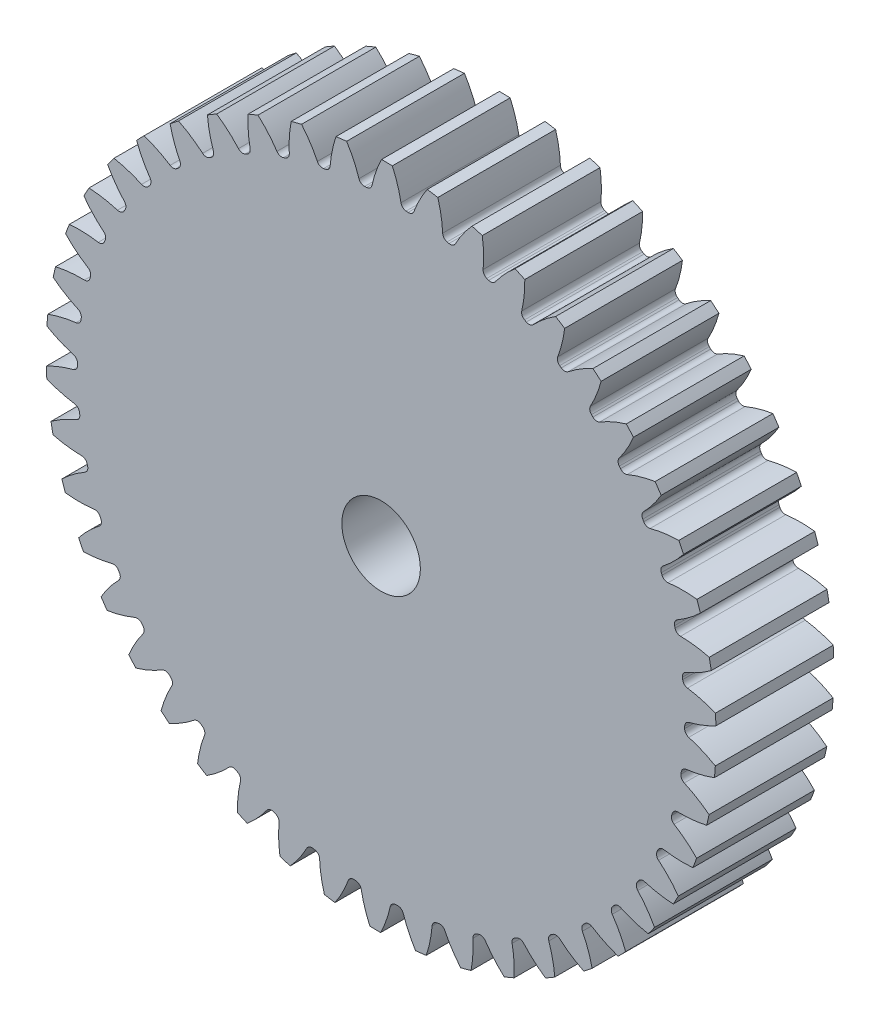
from build123d import *

# Parameters (mm, degrees)
SKETCH3_R         = 270.933333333
GEARBODY_DEPTH    = 95.25
TOOTHCUT_DEPTH    = 395.819331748
CIRPATTERN1_COUNT = 46
BOREDIA_R         = 31.75
BORE_DEPTH        = 12700


with BuildPart() as part:
    # Sketch3 → gearBody (new body)
    with BuildSketch(Plane.XY):
        Circle(SKETCH3_R)
    extrude(amount=GEARBODY_DEPTH)

    # Sketch2 → toothCut (cut, through all)
    with BuildSketch(Plane.XY):
        with BuildLine():
            ThreePointArc((245.480343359, -5.100862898), (245.495900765, -4.2872468), (245.508761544, -3.473583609))
            ThreePointArc((245.508761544, -3.473583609), (246.495112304, -0.693559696), (248.968553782, 0.913769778))
            ThreePointArc((248.968553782, 0.913769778), (260.217939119, 4.535069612), (270.933333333, 9.519325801))
            ThreePointArc((270.933333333, 9.519325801), (271.05918358, -4.733674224), (270.435743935, -18.973588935))
            ThreePointArc((270.435743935, -18.973588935), (259.900916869, -13.618226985), (248.784834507, -9.606345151))
            ThreePointArc((248.784834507, -9.606345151), (246.369023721, -7.91363164), (245.480343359, -5.100862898))
        make_face()
    toothcut = extrude(amount=TOOTHCUT_DEPTH, mode=Mode.SUBTRACT)

    # CirPattern1: toothCut ×46 about axis
    cirpattern1_axis = Axis((0, 0, 0), (0, 0, 1))
    for i in range(1, CIRPATTERN1_COUNT):
        add(toothcut.rotate(cirpattern1_axis, i * 360 / CIRPATTERN1_COUNT), mode=Mode.SUBTRACT)

    # boreDia → bore (cut, symmetric)
    with BuildSketch(Plane.XY):
        Circle(BOREDIA_R)
    extrude(amount=BORE_DEPTH, both=True, mode=Mode.SUBTRACT)


solid = part.part
